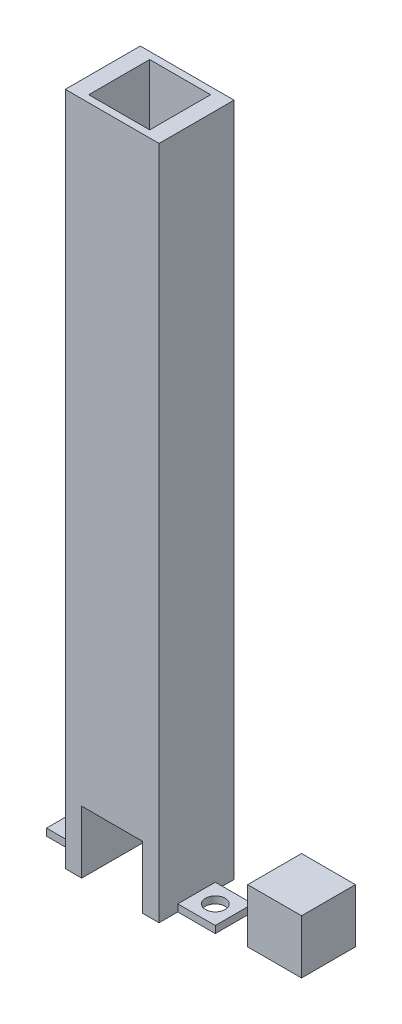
ISO-10303-21;
HEADER;
FILE_DESCRIPTION(('STEP AP214'),'2;1');
FILE_NAME('part.step','',(''),(''),'','','');
FILE_SCHEMA(('AUTOMOTIVE_DESIGN { 1 0 10303 214 1 1 1 1 }'));
ENDSEC;
DATA;
#1=APPLICATION_CONTEXT('core data for automotive mechanical design processes');
#2=APPLICATION_PROTOCOL_DEFINITION('international standard','automotive_design',2000,#1);
#3=PRODUCT_CONTEXT('',#1,'mechanical');
#4=PRODUCT('Part','Part','',(#3));
#5=PRODUCT_RELATED_PRODUCT_CATEGORY('part','',(#4));
#6=PRODUCT_DEFINITION_FORMATION('','',#4);
#7=PRODUCT_DEFINITION_CONTEXT('part definition',#1,'design');
#8=PRODUCT_DEFINITION('design','',#6,#7);
#9=PRODUCT_DEFINITION_SHAPE('','',#8);
#10=(LENGTH_UNIT() NAMED_UNIT(*) SI_UNIT(.MILLI.,.METRE.));
#11=(NAMED_UNIT(*) PLANE_ANGLE_UNIT() SI_UNIT($,.RADIAN.));
#12=(NAMED_UNIT(*) SI_UNIT($,.STERADIAN.) SOLID_ANGLE_UNIT());
#13=UNCERTAINTY_MEASURE_WITH_UNIT(LENGTH_MEASURE(1.E-05),#10,'distance_accuracy_value','');
#14=(GEOMETRIC_REPRESENTATION_CONTEXT(3) GLOBAL_UNCERTAINTY_ASSIGNED_CONTEXT((#13)) GLOBAL_UNIT_ASSIGNED_CONTEXT((#10,
#11,#12)) REPRESENTATION_CONTEXT('',''));
#15=CARTESIAN_POINT('',(0.,0.,0.));
#16=DIRECTION('',(0.,0.,1.));
#17=DIRECTION('',(1.,0.,0.));
#18=AXIS2_PLACEMENT_3D('',#15,#16,#17);
#19=CARTESIAN_POINT('',(-45.8981588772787,-12.,16.));
#20=DIRECTION('',(1.,0.,0.));
#21=DIRECTION('',(0.,0.,-1.));
#22=AXIS2_PLACEMENT_3D('',#19,#20,#21);
#23=PLANE('',#22);
#24=DIRECTION('',(0.,-1.,0.));
#25=VECTOR('',#24,1.);
#26=CARTESIAN_POINT('',(-45.8981588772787,-12.,4.));
#27=LINE('',#26,#25);
#28=CARTESIAN_POINT('',(-45.8981588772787,-10.5,4.));
#29=VERTEX_POINT('',#28);
#30=CARTESIAN_POINT('',(-45.8981588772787,-12.,4.));
#31=VERTEX_POINT('',#30);
#32=EDGE_CURVE('E69',#29,#31,#27,.T.);
#33=ORIENTED_EDGE('',*,*,#32,.F.);
#34=DIRECTION('',(0.,0.,-1.));
#35=VECTOR('',#34,1.);
#36=CARTESIAN_POINT('',(-45.8981588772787,-10.5,4.));
#37=LINE('',#36,#35);
#38=CARTESIAN_POINT('',(-45.8981588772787,-10.5,12.));
#39=VERTEX_POINT('',#38);
#40=EDGE_CURVE('E230',#39,#29,#37,.T.);
#41=ORIENTED_EDGE('',*,*,#40,.F.);
#42=DIRECTION('',(0.,1.,0.));
#43=VECTOR('',#42,1.);
#44=CARTESIAN_POINT('',(-45.8981588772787,-12.,12.));
#45=LINE('',#44,#43);
#46=CARTESIAN_POINT('',(-45.8981588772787,-12.,12.));
#47=VERTEX_POINT('',#46);
#48=EDGE_CURVE('E238',#47,#39,#45,.T.);
#49=ORIENTED_EDGE('',*,*,#48,.F.);
#50=DIRECTION('',(0.,0.,-1.));
#51=VECTOR('',#50,1.);
#52=CARTESIAN_POINT('',(-45.8981588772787,-12.,16.));
#53=LINE('',#52,#51);
#54=CARTESIAN_POINT('',(-45.8981588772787,-12.,16.));
#55=VERTEX_POINT('',#54);
#56=EDGE_CURVE('E12',#55,#47,#53,.T.);
#57=ORIENTED_EDGE('',*,*,#56,.F.);
#58=DIRECTION('',(0.,-1.,0.));
#59=VECTOR('',#58,1.);
#60=CARTESIAN_POINT('',(-45.8981588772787,-12.,16.));
#61=LINE('',#60,#59);
#62=CARTESIAN_POINT('',(-45.8981588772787,132.,16.));
#63=VERTEX_POINT('',#62);
#64=EDGE_CURVE('E310',#63,#55,#61,.T.);
#65=ORIENTED_EDGE('',*,*,#64,.F.);
#66=DIRECTION('',(0.,0.,-1.));
#67=VECTOR('',#66,1.);
#68=CARTESIAN_POINT('',(-45.8981588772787,132.,16.));
#69=LINE('',#68,#67);
#70=CARTESIAN_POINT('',(-45.8981588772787,132.,0.));
#71=VERTEX_POINT('',#70);
#72=EDGE_CURVE('E322',#63,#71,#69,.T.);
#73=ORIENTED_EDGE('',*,*,#72,.T.);
#74=DIRECTION('',(0.,-1.,0.));
#75=VECTOR('',#74,1.);
#76=CARTESIAN_POINT('',(-45.8981588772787,-12.,0.));
#77=LINE('',#76,#75);
#78=CARTESIAN_POINT('',(-45.8981588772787,-12.,0.));
#79=VERTEX_POINT('',#78);
#80=EDGE_CURVE('E304',#71,#79,#77,.T.);
#81=ORIENTED_EDGE('',*,*,#80,.T.);
#82=EDGE_CURVE('E54',#31,#79,#53,.T.);
#83=ORIENTED_EDGE('',*,*,#82,.F.);
#84=EDGE_LOOP('',(#33,#41,#49,#57,#65,#73,#81,#83));
#85=FACE_BOUND('',#84,.T.);
#86=ADVANCED_FACE('F47',(#85),#23,.F.);
#87=CARTESIAN_POINT('',(-45.8981588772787,-12.,16.));
#88=DIRECTION('',(0.,1.,0.));
#89=DIRECTION('',(0.,0.,1.));
#90=AXIS2_PLACEMENT_3D('',#87,#88,#89);
#91=PLANE('',#90);
#92=CARTESIAN_POINT('',(-49.8981588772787,-12.,8.));
#93=DIRECTION('',(0.,1.,0.));
#94=DIRECTION('',(0.,0.,1.));
#95=AXIS2_PLACEMENT_3D('',#92,#93,#94);
#96=CIRCLE('',#95,2.1);
#97=CARTESIAN_POINT('',(-49.8981588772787,-12.,10.1));
#98=VERTEX_POINT('',#97);
#99=EDGE_CURVE('E223',#98,#98,#96,.T.);
#100=ORIENTED_EDGE('',*,*,#99,.T.);
#101=EDGE_LOOP('',(#100));
#102=FACE_BOUND('',#101,.T.);
#103=DIRECTION('',(1.,0.,0.));
#104=VECTOR('',#103,1.);
#105=CARTESIAN_POINT('',(-45.8981588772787,-12.,0.));
#106=LINE('',#105,#104);
#107=CARTESIAN_POINT('',(-42.3981588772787,-12.,0.));
#108=VERTEX_POINT('',#107);
#109=EDGE_CURVE('E326',#79,#108,#106,.T.);
#110=ORIENTED_EDGE('',*,*,#109,.T.);
#111=DIRECTION('',(0.,0.,1.));
#112=VECTOR('',#111,1.);
#113=CARTESIAN_POINT('',(-42.3981588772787,-12.,1.5));
#114=LINE('',#113,#112);
#115=CARTESIAN_POINT('',(-42.3981588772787,-12.,16.));
#116=VERTEX_POINT('',#115);
#117=EDGE_CURVE('E288',#108,#116,#114,.T.);
#118=ORIENTED_EDGE('',*,*,#117,.T.);
#119=DIRECTION('',(1.,0.,0.));
#120=VECTOR('',#119,1.);
#121=CARTESIAN_POINT('',(-45.8981588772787,-12.,16.));
#122=LINE('',#121,#120);
#123=EDGE_CURVE('E315',#55,#116,#122,.T.);
#124=ORIENTED_EDGE('',*,*,#123,.F.);
#125=ORIENTED_EDGE('',*,*,#56,.T.);
#126=DIRECTION('',(1.,0.,0.));
#127=VECTOR('',#126,1.);
#128=CARTESIAN_POINT('',(-53.8981588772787,-12.,12.));
#129=LINE('',#128,#127);
#130=CARTESIAN_POINT('',(-53.8981588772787,-12.,12.));
#131=VERTEX_POINT('',#130);
#132=EDGE_CURVE('E247',#131,#47,#129,.T.);
#133=ORIENTED_EDGE('',*,*,#132,.F.);
#134=DIRECTION('',(0.,0.,1.));
#135=VECTOR('',#134,1.);
#136=CARTESIAN_POINT('',(-53.8981588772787,-12.,4.));
#137=LINE('',#136,#135);
#138=CARTESIAN_POINT('',(-53.8981588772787,-12.,4.));
#139=VERTEX_POINT('',#138);
#140=EDGE_CURVE('E229',#139,#131,#137,.T.);
#141=ORIENTED_EDGE('',*,*,#140,.F.);
#142=DIRECTION('',(1.,0.,0.));
#143=VECTOR('',#142,1.);
#144=CARTESIAN_POINT('',(-53.8981588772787,-12.,4.));
#145=LINE('',#144,#143);
#146=EDGE_CURVE('E250',#139,#31,#145,.T.);
#147=ORIENTED_EDGE('',*,*,#146,.T.);
#148=ORIENTED_EDGE('',*,*,#82,.T.);
#149=EDGE_LOOP('',(#110,#118,#124,#125,#133,#141,#147,#148));
#150=FACE_BOUND('',#149,.T.);
#151=ADVANCED_FACE('F382',(#102,#150),#91,.F.);
#152=CARTESIAN_POINT('',(-21.8981588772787,-12.,8.));
#153=DIRECTION('',(0.,1.,0.));
#154=DIRECTION('',(0.,0.,1.));
#155=AXIS2_PLACEMENT_3D('',#152,#153,#154);
#156=CIRCLE('',#155,2.1);
#157=CARTESIAN_POINT('',(-21.8981588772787,-12.,10.1));
#158=VERTEX_POINT('',#157);
#159=EDGE_CURVE('E213',#158,#158,#156,.F.);
#160=ORIENTED_EDGE('',*,*,#159,.F.);
#161=EDGE_LOOP('',(#160));
#162=FACE_BOUND('',#161,.T.);
#163=DIRECTION('',(0.,0.,1.));
#164=VECTOR('',#163,1.);
#165=CARTESIAN_POINT('',(-29.3981588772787,-12.,1.5));
#166=LINE('',#165,#164);
#167=CARTESIAN_POINT('',(-29.3981588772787,-12.,0.));
#168=VERTEX_POINT('',#167);
#169=CARTESIAN_POINT('',(-29.3981588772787,-12.,16.));
#170=VERTEX_POINT('',#169);
#171=EDGE_CURVE('E286',#168,#170,#166,.T.);
#172=ORIENTED_EDGE('',*,*,#171,.F.);
#173=CARTESIAN_POINT('',(-25.8981588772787,-12.,0.));
#174=VERTEX_POINT('',#173);
#175=EDGE_CURVE('E325',#168,#174,#106,.T.);
#176=ORIENTED_EDGE('',*,*,#175,.T.);
#177=DIRECTION('',(0.,0.,-1.));
#178=VECTOR('',#177,1.);
#179=CARTESIAN_POINT('',(-25.8981588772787,-12.,16.));
#180=LINE('',#179,#178);
#181=CARTESIAN_POINT('',(-25.8981588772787,-12.,4.));
#182=VERTEX_POINT('',#181);
#183=EDGE_CURVE('E336',#182,#174,#180,.T.);
#184=ORIENTED_EDGE('',*,*,#183,.F.);
#185=DIRECTION('',(-1.,0.,0.));
#186=VECTOR('',#185,1.);
#187=CARTESIAN_POINT('',(-17.8981588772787,-12.,4.));
#188=LINE('',#187,#186);
#189=CARTESIAN_POINT('',(-17.8981588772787,-12.,4.));
#190=VERTEX_POINT('',#189);
#191=EDGE_CURVE('E210',#190,#182,#188,.T.);
#192=ORIENTED_EDGE('',*,*,#191,.F.);
#193=DIRECTION('',(0.,0.,1.));
#194=VECTOR('',#193,1.);
#195=CARTESIAN_POINT('',(-17.8981588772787,-12.,4.));
#196=LINE('',#195,#194);
#197=CARTESIAN_POINT('',(-17.8981588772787,-12.,12.));
#198=VERTEX_POINT('',#197);
#199=EDGE_CURVE('E200',#190,#198,#196,.T.);
#200=ORIENTED_EDGE('',*,*,#199,.T.);
#201=DIRECTION('',(-1.,0.,0.));
#202=VECTOR('',#201,1.);
#203=CARTESIAN_POINT('',(-17.8981588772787,-12.,12.));
#204=LINE('',#203,#202);
#205=CARTESIAN_POINT('',(-25.8981588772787,-12.,12.));
#206=VERTEX_POINT('',#205);
#207=EDGE_CURVE('E218',#198,#206,#204,.T.);
#208=ORIENTED_EDGE('',*,*,#207,.T.);
#209=CARTESIAN_POINT('',(-25.8981588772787,-12.,16.));
#210=VERTEX_POINT('',#209);
#211=EDGE_CURVE('E337',#210,#206,#180,.T.);
#212=ORIENTED_EDGE('',*,*,#211,.F.);
#213=EDGE_CURVE('E313',#170,#210,#122,.T.);
#214=ORIENTED_EDGE('',*,*,#213,.F.);
#215=EDGE_LOOP('',(#172,#176,#184,#192,#200,#208,#212,#214));
#216=FACE_BOUND('',#215,.T.);
#217=ADVANCED_FACE('F349',(#162,#216),#91,.F.);
#218=CARTESIAN_POINT('',(-25.8981588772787,-12.,16.));
#219=DIRECTION('',(-1.,0.,0.));
#220=DIRECTION('',(0.,0.,1.));
#221=AXIS2_PLACEMENT_3D('',#218,#219,#220);
#222=PLANE('',#221);
#223=DIRECTION('',(0.,0.,-1.));
#224=VECTOR('',#223,1.);
#225=CARTESIAN_POINT('',(-25.8981588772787,-10.5,4.));
#226=LINE('',#225,#224);
#227=CARTESIAN_POINT('',(-25.8981588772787,-10.5,12.));
#228=VERTEX_POINT('',#227);
#229=CARTESIAN_POINT('',(-25.8981588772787,-10.5,4.));
#230=VERTEX_POINT('',#229);
#231=EDGE_CURVE('E212',#228,#230,#226,.T.);
#232=ORIENTED_EDGE('',*,*,#231,.T.);
#233=DIRECTION('',(0.,-1.,0.));
#234=VECTOR('',#233,1.);
#235=CARTESIAN_POINT('',(-25.8981588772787,-12.,4.));
#236=LINE('',#235,#234);
#237=EDGE_CURVE('E61',#230,#182,#236,.T.);
#238=ORIENTED_EDGE('',*,*,#237,.T.);
#239=ORIENTED_EDGE('',*,*,#183,.T.);
#240=DIRECTION('',(0.,1.,0.));
#241=VECTOR('',#240,1.);
#242=CARTESIAN_POINT('',(-25.8981588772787,-12.,0.));
#243=LINE('',#242,#241);
#244=CARTESIAN_POINT('',(-25.8981588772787,132.,0.));
#245=VERTEX_POINT('',#244);
#246=EDGE_CURVE('E329',#174,#245,#243,.T.);
#247=ORIENTED_EDGE('',*,*,#246,.T.);
#248=DIRECTION('',(0.,0.,-1.));
#249=VECTOR('',#248,1.);
#250=CARTESIAN_POINT('',(-25.8981588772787,132.,16.));
#251=LINE('',#250,#249);
#252=CARTESIAN_POINT('',(-25.8981588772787,132.,16.));
#253=VERTEX_POINT('',#252);
#254=EDGE_CURVE('E334',#253,#245,#251,.T.);
#255=ORIENTED_EDGE('',*,*,#254,.F.);
#256=DIRECTION('',(0.,1.,0.));
#257=VECTOR('',#256,1.);
#258=CARTESIAN_POINT('',(-25.8981588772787,-12.,16.));
#259=LINE('',#258,#257);
#260=EDGE_CURVE('E318',#210,#253,#259,.T.);
#261=ORIENTED_EDGE('',*,*,#260,.F.);
#262=ORIENTED_EDGE('',*,*,#211,.T.);
#263=DIRECTION('',(0.,1.,0.));
#264=VECTOR('',#263,1.);
#265=CARTESIAN_POINT('',(-25.8981588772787,-12.,12.));
#266=LINE('',#265,#264);
#267=EDGE_CURVE('E201',#206,#228,#266,.T.);
#268=ORIENTED_EDGE('',*,*,#267,.T.);
#269=EDGE_LOOP('',(#232,#238,#239,#247,#255,#261,#262,#268));
#270=FACE_BOUND('',#269,.T.);
#271=ADVANCED_FACE('F344',(#270),#222,.F.);
#272=CARTESIAN_POINT('',(-45.8981588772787,132.,16.));
#273=DIRECTION('',(0.,-1.,0.));
#274=DIRECTION('',(0.,0.,-1.));
#275=AXIS2_PLACEMENT_3D('',#272,#273,#274);
#276=PLANE('',#275);
#277=DIRECTION('',(0.,0.,1.));
#278=VECTOR('',#277,1.);
#279=CARTESIAN_POINT('',(-29.3981588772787,132.,1.5));
#280=LINE('',#279,#278);
#281=CARTESIAN_POINT('',(-29.3981588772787,132.,1.5));
#282=VERTEX_POINT('',#281);
#283=CARTESIAN_POINT('',(-29.3981588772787,132.,14.5));
#284=VERTEX_POINT('',#283);
#285=EDGE_CURVE('E294',#282,#284,#280,.T.);
#286=ORIENTED_EDGE('',*,*,#285,.T.);
#287=DIRECTION('',(1.,0.,0.));
#288=VECTOR('',#287,1.);
#289=CARTESIAN_POINT('',(-42.3981588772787,132.,14.5));
#290=LINE('',#289,#288);
#291=CARTESIAN_POINT('',(-42.3981588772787,132.,14.5));
#292=VERTEX_POINT('',#291);
#293=EDGE_CURVE('E285',#292,#284,#290,.T.);
#294=ORIENTED_EDGE('',*,*,#293,.F.);
#295=DIRECTION('',(0.,0.,1.));
#296=VECTOR('',#295,1.);
#297=CARTESIAN_POINT('',(-42.3981588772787,132.,1.5));
#298=LINE('',#297,#296);
#299=CARTESIAN_POINT('',(-42.3981588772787,132.,1.5));
#300=VERTEX_POINT('',#299);
#301=EDGE_CURVE('E289',#300,#292,#298,.T.);
#302=ORIENTED_EDGE('',*,*,#301,.F.);
#303=DIRECTION('',(1.,0.,0.));
#304=VECTOR('',#303,1.);
#305=CARTESIAN_POINT('',(-42.3981588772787,132.,1.5));
#306=LINE('',#305,#304);
#307=EDGE_CURVE('E297',#300,#282,#306,.T.);
#308=ORIENTED_EDGE('',*,*,#307,.T.);
#309=EDGE_LOOP('',(#286,#294,#302,#308));
#310=FACE_BOUND('',#309,.T.);
#311=DIRECTION('',(-1.,0.,0.));
#312=VECTOR('',#311,1.);
#313=CARTESIAN_POINT('',(-45.8981588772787,132.,0.));
#314=LINE('',#313,#312);
#315=EDGE_CURVE('E314',#245,#71,#314,.T.);
#316=ORIENTED_EDGE('',*,*,#315,.T.);
#317=ORIENTED_EDGE('',*,*,#72,.F.);
#318=DIRECTION('',(-1.,0.,0.));
#319=VECTOR('',#318,1.);
#320=CARTESIAN_POINT('',(-45.8981588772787,132.,16.));
#321=LINE('',#320,#319);
#322=EDGE_CURVE('E320',#253,#63,#321,.T.);
#323=ORIENTED_EDGE('',*,*,#322,.F.);
#324=ORIENTED_EDGE('',*,*,#254,.T.);
#325=EDGE_LOOP('',(#316,#317,#323,#324));
#326=FACE_BOUND('',#325,.T.);
#327=ADVANCED_FACE('F359',(#310,#326),#276,.F.);
#328=CARTESIAN_POINT('',(0.,0.,16.));
#329=DIRECTION('',(0.,0.,-1.));
#330=DIRECTION('',(-1.,0.,0.));
#331=AXIS2_PLACEMENT_3D('',#328,#329,#330);
#332=PLANE('',#331);
#333=ORIENTED_EDGE('',*,*,#123,.T.);
#334=DIRECTION('',(0.,-1.,0.));
#335=VECTOR('',#334,1.);
#336=CARTESIAN_POINT('',(-42.3981588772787,1.3,16.));
#337=LINE('',#336,#335);
#338=CARTESIAN_POINT('',(-42.3981588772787,1.3,16.));
#339=VERTEX_POINT('',#338);
#340=EDGE_CURVE('E269',#339,#116,#337,.T.);
#341=ORIENTED_EDGE('',*,*,#340,.F.);
#342=DIRECTION('',(-1.,0.,0.));
#343=VECTOR('',#342,1.);
#344=CARTESIAN_POINT('',(-29.3981588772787,1.3,16.));
#345=LINE('',#344,#343);
#346=CARTESIAN_POINT('',(-29.3981588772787,1.3,16.));
#347=VERTEX_POINT('',#346);
#348=EDGE_CURVE('E277',#347,#339,#345,.T.);
#349=ORIENTED_EDGE('',*,*,#348,.F.);
#350=DIRECTION('',(0.,-1.,0.));
#351=VECTOR('',#350,1.);
#352=CARTESIAN_POINT('',(-29.3981588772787,1.3,16.));
#353=LINE('',#352,#351);
#354=EDGE_CURVE('E274',#347,#170,#353,.T.);
#355=ORIENTED_EDGE('',*,*,#354,.T.);
#356=ORIENTED_EDGE('',*,*,#213,.T.);
#357=ORIENTED_EDGE('',*,*,#260,.T.);
#358=ORIENTED_EDGE('',*,*,#322,.T.);
#359=ORIENTED_EDGE('',*,*,#64,.T.);
#360=EDGE_LOOP('',(#333,#341,#349,#355,#356,#357,#358,#359));
#361=FACE_BOUND('',#360,.T.);
#362=ADVANCED_FACE('F364',(#361),#332,.F.);
#363=CARTESIAN_POINT('',(0.,0.,0.));
#364=DIRECTION('',(0.,0.,-1.));
#365=DIRECTION('',(-1.,0.,0.));
#366=AXIS2_PLACEMENT_3D('',#363,#364,#365);
#367=PLANE('',#366);
#368=DIRECTION('',(0.,-1.,0.));
#369=VECTOR('',#368,1.);
#370=CARTESIAN_POINT('',(-29.3981588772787,-4.,0.));
#371=LINE('',#370,#369);
#372=CARTESIAN_POINT('',(-29.3981588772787,-4.,0.));
#373=VERTEX_POINT('',#372);
#374=EDGE_CURVE('E253',#373,#168,#371,.T.);
#375=ORIENTED_EDGE('',*,*,#374,.F.);
#376=DIRECTION('',(1.,0.,0.));
#377=VECTOR('',#376,1.);
#378=CARTESIAN_POINT('',(-42.3981588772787,-4.,0.));
#379=LINE('',#378,#377);
#380=CARTESIAN_POINT('',(-42.3981588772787,-4.,0.));
#381=VERTEX_POINT('',#380);
#382=EDGE_CURVE('E261',#381,#373,#379,.T.);
#383=ORIENTED_EDGE('',*,*,#382,.F.);
#384=DIRECTION('',(0.,-1.,0.));
#385=VECTOR('',#384,1.);
#386=CARTESIAN_POINT('',(-42.3981588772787,-4.,0.));
#387=LINE('',#386,#385);
#388=EDGE_CURVE('E258',#381,#108,#387,.T.);
#389=ORIENTED_EDGE('',*,*,#388,.T.);
#390=ORIENTED_EDGE('',*,*,#109,.F.);
#391=ORIENTED_EDGE('',*,*,#80,.F.);
#392=ORIENTED_EDGE('',*,*,#315,.F.);
#393=ORIENTED_EDGE('',*,*,#246,.F.);
#394=ORIENTED_EDGE('',*,*,#175,.F.);
#395=EDGE_LOOP('',(#375,#383,#389,#390,#391,#392,#393,#394));
#396=FACE_BOUND('',#395,.T.);
#397=ADVANCED_FACE('F354',(#396),#367,.T.);
#398=CARTESIAN_POINT('',(-42.3981588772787,-12.,14.5));
#399=DIRECTION('',(0.,0.,1.));
#400=DIRECTION('',(1.,0.,0.));
#401=AXIS2_PLACEMENT_3D('',#398,#399,#400);
#402=PLANE('',#401);
#403=DIRECTION('',(0.,1.,0.));
#404=VECTOR('',#403,1.);
#405=CARTESIAN_POINT('',(-29.3981588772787,-12.,14.5));
#406=LINE('',#405,#404);
#407=CARTESIAN_POINT('',(-29.3981588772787,1.3,14.5));
#408=VERTEX_POINT('',#407);
#409=EDGE_CURVE('E291',#408,#284,#406,.T.);
#410=ORIENTED_EDGE('',*,*,#409,.F.);
#411=DIRECTION('',(-1.,0.,0.));
#412=VECTOR('',#411,1.);
#413=CARTESIAN_POINT('',(-29.3981588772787,1.3,14.5));
#414=LINE('',#413,#412);
#415=CARTESIAN_POINT('',(-42.3981588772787,1.3,14.5));
#416=VERTEX_POINT('',#415);
#417=EDGE_CURVE('E270',#408,#416,#414,.T.);
#418=ORIENTED_EDGE('',*,*,#417,.T.);
#419=DIRECTION('',(0.,1.,0.));
#420=VECTOR('',#419,1.);
#421=CARTESIAN_POINT('',(-42.3981588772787,-12.,14.5));
#422=LINE('',#421,#420);
#423=EDGE_CURVE('E302',#416,#292,#422,.T.);
#424=ORIENTED_EDGE('',*,*,#423,.T.);
#425=ORIENTED_EDGE('',*,*,#293,.T.);
#426=EDGE_LOOP('',(#410,#418,#424,#425));
#427=FACE_BOUND('',#426,.T.);
#428=ADVANCED_FACE('F400',(#427),#402,.F.);
#429=CARTESIAN_POINT('',(-42.3981588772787,-12.,1.5));
#430=DIRECTION('',(-1.,0.,0.));
#431=DIRECTION('',(0.,0.,1.));
#432=AXIS2_PLACEMENT_3D('',#429,#430,#431);
#433=PLANE('',#432);
#434=ORIENTED_EDGE('',*,*,#301,.T.);
#435=ORIENTED_EDGE('',*,*,#423,.F.);
#436=DIRECTION('',(0.,0.,1.));
#437=VECTOR('',#436,1.);
#438=CARTESIAN_POINT('',(-42.3981588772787,1.3,14.5));
#439=LINE('',#438,#437);
#440=EDGE_CURVE('E283',#416,#339,#439,.T.);
#441=ORIENTED_EDGE('',*,*,#440,.T.);
#442=ORIENTED_EDGE('',*,*,#340,.T.);
#443=ORIENTED_EDGE('',*,*,#117,.F.);
#444=ORIENTED_EDGE('',*,*,#388,.F.);
#445=DIRECTION('',(0.,0.,-1.));
#446=VECTOR('',#445,1.);
#447=CARTESIAN_POINT('',(-42.3981588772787,-4.,1.5));
#448=LINE('',#447,#446);
#449=CARTESIAN_POINT('',(-42.3981588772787,-4.,1.5));
#450=VERTEX_POINT('',#449);
#451=EDGE_CURVE('E257',#450,#381,#448,.T.);
#452=ORIENTED_EDGE('',*,*,#451,.F.);
#453=DIRECTION('',(0.,1.,0.));
#454=VECTOR('',#453,1.);
#455=CARTESIAN_POINT('',(-42.3981588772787,-12.,1.5));
#456=LINE('',#455,#454);
#457=EDGE_CURVE('E305',#450,#300,#456,.T.);
#458=ORIENTED_EDGE('',*,*,#457,.T.);
#459=EDGE_LOOP('',(#434,#435,#441,#442,#443,#444,#452,#458));
#460=FACE_BOUND('',#459,.T.);
#461=ADVANCED_FACE('F405',(#460),#433,.F.);
#462=CARTESIAN_POINT('',(-42.3981588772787,-12.,1.5));
#463=DIRECTION('',(0.,0.,1.));
#464=DIRECTION('',(1.,0.,0.));
#465=AXIS2_PLACEMENT_3D('',#462,#463,#464);
#466=PLANE('',#465);
#467=DIRECTION('',(1.,0.,0.));
#468=VECTOR('',#467,1.);
#469=CARTESIAN_POINT('',(-42.3981588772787,-4.,1.5));
#470=LINE('',#469,#468);
#471=CARTESIAN_POINT('',(-29.3981588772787,-4.,1.5));
#472=VERTEX_POINT('',#471);
#473=EDGE_CURVE('E254',#450,#472,#470,.T.);
#474=ORIENTED_EDGE('',*,*,#473,.T.);
#475=DIRECTION('',(0.,1.,0.));
#476=VECTOR('',#475,1.);
#477=CARTESIAN_POINT('',(-29.3981588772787,-12.,1.5));
#478=LINE('',#477,#476);
#479=EDGE_CURVE('E307',#472,#282,#478,.T.);
#480=ORIENTED_EDGE('',*,*,#479,.T.);
#481=ORIENTED_EDGE('',*,*,#307,.F.);
#482=ORIENTED_EDGE('',*,*,#457,.F.);
#483=EDGE_LOOP('',(#474,#480,#481,#482));
#484=FACE_BOUND('',#483,.T.);
#485=ADVANCED_FACE('F411',(#484),#466,.T.);
#486=CARTESIAN_POINT('',(-29.3981588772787,-12.,1.5));
#487=DIRECTION('',(-1.,0.,0.));
#488=DIRECTION('',(0.,0.,1.));
#489=AXIS2_PLACEMENT_3D('',#486,#487,#488);
#490=PLANE('',#489);
#491=ORIENTED_EDGE('',*,*,#285,.F.);
#492=ORIENTED_EDGE('',*,*,#479,.F.);
#493=DIRECTION('',(0.,0.,-1.));
#494=VECTOR('',#493,1.);
#495=CARTESIAN_POINT('',(-29.3981588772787,-4.,1.5));
#496=LINE('',#495,#494);
#497=EDGE_CURVE('E267',#472,#373,#496,.T.);
#498=ORIENTED_EDGE('',*,*,#497,.T.);
#499=ORIENTED_EDGE('',*,*,#374,.T.);
#500=ORIENTED_EDGE('',*,*,#171,.T.);
#501=ORIENTED_EDGE('',*,*,#354,.F.);
#502=DIRECTION('',(0.,0.,1.));
#503=VECTOR('',#502,1.);
#504=CARTESIAN_POINT('',(-29.3981588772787,1.3,14.5));
#505=LINE('',#504,#503);
#506=EDGE_CURVE('E273',#408,#347,#505,.T.);
#507=ORIENTED_EDGE('',*,*,#506,.F.);
#508=ORIENTED_EDGE('',*,*,#409,.T.);
#509=EDGE_LOOP('',(#491,#492,#498,#499,#500,#501,#507,#508));
#510=FACE_BOUND('',#509,.T.);
#511=ADVANCED_FACE('F407',(#510),#490,.T.);
#512=CARTESIAN_POINT('',(-29.3981588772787,1.3,14.5));
#513=DIRECTION('',(0.,1.,0.));
#514=DIRECTION('',(-1.,0.,0.));
#515=AXIS2_PLACEMENT_3D('',#512,#513,#514);
#516=PLANE('',#515);
#517=ORIENTED_EDGE('',*,*,#348,.T.);
#518=ORIENTED_EDGE('',*,*,#440,.F.);
#519=ORIENTED_EDGE('',*,*,#417,.F.);
#520=ORIENTED_EDGE('',*,*,#506,.T.);
#521=EDGE_LOOP('',(#517,#518,#519,#520));
#522=FACE_BOUND('',#521,.T.);
#523=ADVANCED_FACE('F410',(#522),#516,.F.);
#524=CARTESIAN_POINT('',(-42.3981588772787,-4.,1.5));
#525=DIRECTION('',(0.,1.,0.));
#526=DIRECTION('',(-1.,0.,0.));
#527=AXIS2_PLACEMENT_3D('',#524,#525,#526);
#528=PLANE('',#527);
#529=ORIENTED_EDGE('',*,*,#382,.T.);
#530=ORIENTED_EDGE('',*,*,#497,.F.);
#531=ORIENTED_EDGE('',*,*,#473,.F.);
#532=ORIENTED_EDGE('',*,*,#451,.T.);
#533=EDGE_LOOP('',(#529,#530,#531,#532));
#534=FACE_BOUND('',#533,.T.);
#535=ADVANCED_FACE('F421',(#534),#528,.F.);
#536=CARTESIAN_POINT('',(-53.8981588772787,-12.,4.));
#537=DIRECTION('',(0.,0.,1.));
#538=DIRECTION('',(1.,0.,0.));
#539=AXIS2_PLACEMENT_3D('',#536,#537,#538);
#540=PLANE('',#539);
#541=ORIENTED_EDGE('',*,*,#32,.T.);
#542=ORIENTED_EDGE('',*,*,#146,.F.);
#543=DIRECTION('',(0.,-1.,0.));
#544=VECTOR('',#543,1.);
#545=CARTESIAN_POINT('',(-53.8981588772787,-12.,4.));
#546=LINE('',#545,#544);
#547=CARTESIAN_POINT('',(-53.8981588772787,-10.5,4.));
#548=VERTEX_POINT('',#547);
#549=EDGE_CURVE('E226',#548,#139,#546,.T.);
#550=ORIENTED_EDGE('',*,*,#549,.F.);
#551=DIRECTION('',(1.,0.,0.));
#552=VECTOR('',#551,1.);
#553=CARTESIAN_POINT('',(-53.8981588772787,-10.5,4.));
#554=LINE('',#553,#552);
#555=EDGE_CURVE('E236',#548,#29,#554,.T.);
#556=ORIENTED_EDGE('',*,*,#555,.T.);
#557=EDGE_LOOP('',(#541,#542,#550,#556));
#558=FACE_BOUND('',#557,.T.);
#559=ADVANCED_FACE('F425',(#558),#540,.F.);
#560=CARTESIAN_POINT('',(-53.8981588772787,-12.,12.));
#561=DIRECTION('',(0.,0.,-1.));
#562=DIRECTION('',(-1.,0.,0.));
#563=AXIS2_PLACEMENT_3D('',#560,#561,#562);
#564=PLANE('',#563);
#565=ORIENTED_EDGE('',*,*,#48,.T.);
#566=DIRECTION('',(1.,0.,0.));
#567=VECTOR('',#566,1.);
#568=CARTESIAN_POINT('',(-53.8981588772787,-10.5,12.));
#569=LINE('',#568,#567);
#570=CARTESIAN_POINT('',(-53.8981588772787,-10.5,12.));
#571=VERTEX_POINT('',#570);
#572=EDGE_CURVE('E244',#571,#39,#569,.T.);
#573=ORIENTED_EDGE('',*,*,#572,.F.);
#574=DIRECTION('',(0.,1.,0.));
#575=VECTOR('',#574,1.);
#576=CARTESIAN_POINT('',(-53.8981588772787,-12.,12.));
#577=LINE('',#576,#575);
#578=EDGE_CURVE('E232',#131,#571,#577,.T.);
#579=ORIENTED_EDGE('',*,*,#578,.F.);
#580=ORIENTED_EDGE('',*,*,#132,.T.);
#581=EDGE_LOOP('',(#565,#573,#579,#580));
#582=FACE_BOUND('',#581,.T.);
#583=ADVANCED_FACE('F429',(#582),#564,.F.);
#584=CARTESIAN_POINT('',(-53.8981588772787,-10.5,4.));
#585=DIRECTION('',(0.,-1.,0.));
#586=DIRECTION('',(0.,0.,-1.));
#587=AXIS2_PLACEMENT_3D('',#584,#585,#586);
#588=PLANE('',#587);
#589=CARTESIAN_POINT('',(-49.8981588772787,-10.5,8.));
#590=DIRECTION('',(0.,1.,0.));
#591=DIRECTION('',(0.,0.,1.));
#592=AXIS2_PLACEMENT_3D('',#589,#590,#591);
#593=CIRCLE('',#592,2.1);
#594=CARTESIAN_POINT('',(-49.8981588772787,-10.5,10.1));
#595=VERTEX_POINT('',#594);
#596=EDGE_CURVE('E190',#595,#595,#593,.T.);
#597=ORIENTED_EDGE('',*,*,#596,.F.);
#598=EDGE_LOOP('',(#597));
#599=FACE_BOUND('',#598,.T.);
#600=ORIENTED_EDGE('',*,*,#40,.T.);
#601=ORIENTED_EDGE('',*,*,#555,.F.);
#602=DIRECTION('',(0.,0.,-1.));
#603=VECTOR('',#602,1.);
#604=CARTESIAN_POINT('',(-53.8981588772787,-10.5,4.));
#605=LINE('',#604,#603);
#606=EDGE_CURVE('E234',#571,#548,#605,.T.);
#607=ORIENTED_EDGE('',*,*,#606,.F.);
#608=ORIENTED_EDGE('',*,*,#572,.T.);
#609=EDGE_LOOP('',(#600,#601,#607,#608));
#610=FACE_BOUND('',#609,.T.);
#611=ADVANCED_FACE('F433',(#599,#610),#588,.F.);
#612=CARTESIAN_POINT('',(-53.8981588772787,0.,0.));
#613=DIRECTION('',(1.,0.,0.));
#614=DIRECTION('',(0.,0.,-1.));
#615=AXIS2_PLACEMENT_3D('',#612,#613,#614);
#616=PLANE('',#615);
#617=ORIENTED_EDGE('',*,*,#549,.T.);
#618=ORIENTED_EDGE('',*,*,#140,.T.);
#619=ORIENTED_EDGE('',*,*,#578,.T.);
#620=ORIENTED_EDGE('',*,*,#606,.T.);
#621=EDGE_LOOP('',(#617,#618,#619,#620));
#622=FACE_BOUND('',#621,.T.);
#623=ADVANCED_FACE('F437',(#622),#616,.F.);
#624=CARTESIAN_POINT('',(-49.8981588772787,-20.5,8.));
#625=DIRECTION('',(0.,1.,0.));
#626=DIRECTION('',(0.,0.,1.));
#627=AXIS2_PLACEMENT_3D('',#624,#625,#626);
#628=CYLINDRICAL_SURFACE('',#627,2.1);
#629=ORIENTED_EDGE('',*,*,#596,.T.);
#630=EDGE_LOOP('',(#629));
#631=FACE_BOUND('',#630,.T.);
#632=ORIENTED_EDGE('',*,*,#99,.F.);
#633=EDGE_LOOP('',(#632));
#634=FACE_BOUND('',#633,.T.);
#635=ADVANCED_FACE('F441',(#631,#634),#628,.F.);
#636=CARTESIAN_POINT('',(-17.8981588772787,-12.,4.));
#637=DIRECTION('',(0.,0.,-1.));
#638=DIRECTION('',(-1.,0.,0.));
#639=AXIS2_PLACEMENT_3D('',#636,#637,#638);
#640=PLANE('',#639);
#641=ORIENTED_EDGE('',*,*,#237,.F.);
#642=DIRECTION('',(-1.,0.,0.));
#643=VECTOR('',#642,1.);
#644=CARTESIAN_POINT('',(-17.8981588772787,-10.5,4.));
#645=LINE('',#644,#643);
#646=CARTESIAN_POINT('',(-17.8981588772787,-10.5,4.));
#647=VERTEX_POINT('',#646);
#648=EDGE_CURVE('E181',#647,#230,#645,.T.);
#649=ORIENTED_EDGE('',*,*,#648,.F.);
#650=DIRECTION('',(0.,-1.,0.));
#651=VECTOR('',#650,1.);
#652=CARTESIAN_POINT('',(-17.8981588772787,-12.,4.));
#653=LINE('',#652,#651);
#654=EDGE_CURVE('E184',#647,#190,#653,.T.);
#655=ORIENTED_EDGE('',*,*,#654,.T.);
#656=ORIENTED_EDGE('',*,*,#191,.T.);
#657=EDGE_LOOP('',(#641,#649,#655,#656));
#658=FACE_BOUND('',#657,.T.);
#659=ADVANCED_FACE('F183',(#658),#640,.T.);
#660=CARTESIAN_POINT('',(-17.8981588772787,-10.5,4.));
#661=DIRECTION('',(0.,1.,0.));
#662=DIRECTION('',(0.,0.,1.));
#663=AXIS2_PLACEMENT_3D('',#660,#661,#662);
#664=PLANE('',#663);
#665=CARTESIAN_POINT('',(-21.8981588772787,-10.5,8.));
#666=DIRECTION('',(0.,-1.,0.));
#667=DIRECTION('',(0.,0.,1.));
#668=AXIS2_PLACEMENT_3D('',#665,#666,#667);
#669=CIRCLE('',#668,2.1);
#670=CARTESIAN_POINT('',(-21.8981588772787,-10.5,10.1));
#671=VERTEX_POINT('',#670);
#672=EDGE_CURVE('E482',#671,#671,#669,.T.);
#673=ORIENTED_EDGE('',*,*,#672,.T.);
#674=EDGE_LOOP('',(#673));
#675=FACE_BOUND('',#674,.T.);
#676=ORIENTED_EDGE('',*,*,#231,.F.);
#677=DIRECTION('',(-1.,0.,0.));
#678=VECTOR('',#677,1.);
#679=CARTESIAN_POINT('',(-17.8981588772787,-10.5,12.));
#680=LINE('',#679,#678);
#681=CARTESIAN_POINT('',(-17.8981588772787,-10.5,12.));
#682=VERTEX_POINT('',#681);
#683=EDGE_CURVE('E191',#682,#228,#680,.T.);
#684=ORIENTED_EDGE('',*,*,#683,.F.);
#685=DIRECTION('',(0.,0.,-1.));
#686=VECTOR('',#685,1.);
#687=CARTESIAN_POINT('',(-17.8981588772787,-10.5,4.));
#688=LINE('',#687,#686);
#689=EDGE_CURVE('E197',#682,#647,#688,.T.);
#690=ORIENTED_EDGE('',*,*,#689,.T.);
#691=ORIENTED_EDGE('',*,*,#648,.T.);
#692=EDGE_LOOP('',(#676,#684,#690,#691));
#693=FACE_BOUND('',#692,.T.);
#694=ADVANCED_FACE('F203',(#675,#693),#664,.T.);
#695=CARTESIAN_POINT('',(-17.8981588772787,-12.,12.));
#696=DIRECTION('',(0.,0.,1.));
#697=DIRECTION('',(1.,0.,0.));
#698=AXIS2_PLACEMENT_3D('',#695,#696,#697);
#699=PLANE('',#698);
#700=ORIENTED_EDGE('',*,*,#267,.F.);
#701=ORIENTED_EDGE('',*,*,#207,.F.);
#702=DIRECTION('',(0.,1.,0.));
#703=VECTOR('',#702,1.);
#704=CARTESIAN_POINT('',(-17.8981588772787,-12.,12.));
#705=LINE('',#704,#703);
#706=EDGE_CURVE('E204',#198,#682,#705,.T.);
#707=ORIENTED_EDGE('',*,*,#706,.T.);
#708=ORIENTED_EDGE('',*,*,#683,.T.);
#709=EDGE_LOOP('',(#700,#701,#707,#708));
#710=FACE_BOUND('',#709,.T.);
#711=ADVANCED_FACE('F370',(#710),#699,.T.);
#712=CARTESIAN_POINT('',(-17.8981588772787,0.,0.));
#713=DIRECTION('',(-1.,0.,0.));
#714=DIRECTION('',(0.,0.,-1.));
#715=AXIS2_PLACEMENT_3D('',#712,#713,#714);
#716=PLANE('',#715);
#717=ORIENTED_EDGE('',*,*,#654,.F.);
#718=ORIENTED_EDGE('',*,*,#689,.F.);
#719=ORIENTED_EDGE('',*,*,#706,.F.);
#720=ORIENTED_EDGE('',*,*,#199,.F.);
#721=EDGE_LOOP('',(#717,#718,#719,#720));
#722=FACE_BOUND('',#721,.T.);
#723=ADVANCED_FACE('F195',(#722),#716,.F.);
#724=CARTESIAN_POINT('',(-21.8981588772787,-20.5,8.));
#725=DIRECTION('',(0.,1.,0.));
#726=DIRECTION('',(0.,0.,1.));
#727=AXIS2_PLACEMENT_3D('',#724,#725,#726);
#728=CYLINDRICAL_SURFACE('',#727,2.1);
#729=ORIENTED_EDGE('',*,*,#672,.F.);
#730=EDGE_LOOP('',(#729));
#731=FACE_BOUND('',#730,.T.);
#732=ORIENTED_EDGE('',*,*,#159,.T.);
#733=EDGE_LOOP('',(#732));
#734=FACE_BOUND('',#733,.T.);
#735=ADVANCED_FACE('F377',(#731,#734),#728,.F.);
#736=CLOSED_SHELL('',(#86,#151,#217,#271,#327,#362,#397,#428,#461,#485,#511,#523,#535,#559,#583,
#611,#623,#635,#659,#694,#711,#723,#735));
#737=MANIFOLD_SOLID_BREP('B2',#736);
#738=CARTESIAN_POINT('',(0.,0.,11.5));
#739=DIRECTION('',(-1.,0.,0.));
#740=DIRECTION('',(0.,-1.,0.));
#741=AXIS2_PLACEMENT_3D('',#738,#739,#740);
#742=PLANE('',#741);
#743=DIRECTION('',(0.,1.,0.));
#744=VECTOR('',#743,1.);
#745=CARTESIAN_POINT('',(0.,0.,0.));
#746=LINE('',#745,#744);
#747=CARTESIAN_POINT('',(0.,-11.5,0.));
#748=VERTEX_POINT('',#747);
#749=CARTESIAN_POINT('',(0.,0.,0.));
#750=VERTEX_POINT('',#749);
#751=EDGE_CURVE('E696',#748,#750,#746,.T.);
#752=ORIENTED_EDGE('',*,*,#751,.T.);
#753=DIRECTION('',(0.,0.,-1.));
#754=VECTOR('',#753,1.);
#755=CARTESIAN_POINT('',(0.,0.,11.5));
#756=LINE('',#755,#754);
#757=CARTESIAN_POINT('',(0.,0.,11.5));
#758=VERTEX_POINT('',#757);
#759=EDGE_CURVE('E45',#758,#750,#756,.T.);
#760=ORIENTED_EDGE('',*,*,#759,.F.);
#761=DIRECTION('',(0.,1.,0.));
#762=VECTOR('',#761,1.);
#763=CARTESIAN_POINT('',(0.,0.,11.5));
#764=LINE('',#763,#762);
#765=CARTESIAN_POINT('',(0.,-11.5,11.5));
#766=VERTEX_POINT('',#765);
#767=EDGE_CURVE('E684',#766,#758,#764,.T.);
#768=ORIENTED_EDGE('',*,*,#767,.F.);
#769=DIRECTION('',(0.,0.,-1.));
#770=VECTOR('',#769,1.);
#771=CARTESIAN_POINT('',(0.,-11.5,11.5));
#772=LINE('',#771,#770);
#773=EDGE_CURVE('E692',#766,#748,#772,.T.);
#774=ORIENTED_EDGE('',*,*,#773,.T.);
#775=EDGE_LOOP('',(#752,#760,#768,#774));
#776=FACE_BOUND('',#775,.T.);
#777=ADVANCED_FACE('F633',(#776),#742,.F.);
#778=CARTESIAN_POINT('',(0.,0.,11.5));
#779=DIRECTION('',(0.,-1.,0.));
#780=DIRECTION('',(1.,0.,0.));
#781=AXIS2_PLACEMENT_3D('',#778,#779,#780);
#782=PLANE('',#781);
#783=DIRECTION('',(-1.,0.,0.));
#784=VECTOR('',#783,1.);
#785=CARTESIAN_POINT('',(0.,0.,0.));
#786=LINE('',#785,#784);
#787=CARTESIAN_POINT('',(-11.5,0.,0.));
#788=VERTEX_POINT('',#787);
#789=EDGE_CURVE('E688',#750,#788,#786,.T.);
#790=ORIENTED_EDGE('',*,*,#789,.T.);
#791=DIRECTION('',(0.,0.,-1.));
#792=VECTOR('',#791,1.);
#793=CARTESIAN_POINT('',(-11.5,0.,11.5));
#794=LINE('',#793,#792);
#795=CARTESIAN_POINT('',(-11.5,0.,11.5));
#796=VERTEX_POINT('',#795);
#797=EDGE_CURVE('E641',#796,#788,#794,.T.);
#798=ORIENTED_EDGE('',*,*,#797,.F.);
#799=DIRECTION('',(-1.,0.,0.));
#800=VECTOR('',#799,1.);
#801=CARTESIAN_POINT('',(0.,0.,11.5));
#802=LINE('',#801,#800);
#803=EDGE_CURVE('E679',#758,#796,#802,.T.);
#804=ORIENTED_EDGE('',*,*,#803,.F.);
#805=ORIENTED_EDGE('',*,*,#759,.T.);
#806=EDGE_LOOP('',(#790,#798,#804,#805));
#807=FACE_BOUND('',#806,.T.);
#808=ADVANCED_FACE('F687',(#807),#782,.F.);
#809=CARTESIAN_POINT('',(-11.5,0.,11.5));
#810=DIRECTION('',(1.,0.,0.));
#811=DIRECTION('',(0.,1.,0.));
#812=AXIS2_PLACEMENT_3D('',#809,#810,#811);
#813=PLANE('',#812);
#814=DIRECTION('',(0.,-1.,0.));
#815=VECTOR('',#814,1.);
#816=CARTESIAN_POINT('',(-11.5,0.,0.));
#817=LINE('',#816,#815);
#818=CARTESIAN_POINT('',(-11.5,-11.5,0.));
#819=VERTEX_POINT('',#818);
#820=EDGE_CURVE('E666',#788,#819,#817,.T.);
#821=ORIENTED_EDGE('',*,*,#820,.T.);
#822=DIRECTION('',(0.,0.,-1.));
#823=VECTOR('',#822,1.);
#824=CARTESIAN_POINT('',(-11.5,-11.5,11.5));
#825=LINE('',#824,#823);
#826=CARTESIAN_POINT('',(-11.5,-11.5,11.5));
#827=VERTEX_POINT('',#826);
#828=EDGE_CURVE('E689',#827,#819,#825,.T.);
#829=ORIENTED_EDGE('',*,*,#828,.F.);
#830=DIRECTION('',(0.,-1.,0.));
#831=VECTOR('',#830,1.);
#832=CARTESIAN_POINT('',(-11.5,0.,11.5));
#833=LINE('',#832,#831);
#834=EDGE_CURVE('E682',#796,#827,#833,.T.);
#835=ORIENTED_EDGE('',*,*,#834,.F.);
#836=ORIENTED_EDGE('',*,*,#797,.T.);
#837=EDGE_LOOP('',(#821,#829,#835,#836));
#838=FACE_BOUND('',#837,.T.);
#839=ADVANCED_FACE('F690',(#838),#813,.F.);
#840=CARTESIAN_POINT('',(0.,-11.5,11.5));
#841=DIRECTION('',(0.,1.,0.));
#842=DIRECTION('',(-1.,0.,0.));
#843=AXIS2_PLACEMENT_3D('',#840,#841,#842);
#844=PLANE('',#843);
#845=DIRECTION('',(1.,0.,0.));
#846=VECTOR('',#845,1.);
#847=CARTESIAN_POINT('',(0.,-11.5,0.));
#848=LINE('',#847,#846);
#849=EDGE_CURVE('E672',#819,#748,#848,.T.);
#850=ORIENTED_EDGE('',*,*,#849,.T.);
#851=ORIENTED_EDGE('',*,*,#773,.F.);
#852=DIRECTION('',(1.,0.,0.));
#853=VECTOR('',#852,1.);
#854=CARTESIAN_POINT('',(0.,-11.5,11.5));
#855=LINE('',#854,#853);
#856=EDGE_CURVE('E649',#827,#766,#855,.T.);
#857=ORIENTED_EDGE('',*,*,#856,.F.);
#858=ORIENTED_EDGE('',*,*,#828,.T.);
#859=EDGE_LOOP('',(#850,#851,#857,#858));
#860=FACE_BOUND('',#859,.T.);
#861=ADVANCED_FACE('F703',(#860),#844,.F.);
#862=CARTESIAN_POINT('',(0.,0.,11.5));
#863=DIRECTION('',(0.,0.,-1.));
#864=DIRECTION('',(-1.,0.,0.));
#865=AXIS2_PLACEMENT_3D('',#862,#863,#864);
#866=PLANE('',#865);
#867=ORIENTED_EDGE('',*,*,#767,.T.);
#868=ORIENTED_EDGE('',*,*,#803,.T.);
#869=ORIENTED_EDGE('',*,*,#834,.T.);
#870=ORIENTED_EDGE('',*,*,#856,.T.);
#871=EDGE_LOOP('',(#867,#868,#869,#870));
#872=FACE_BOUND('',#871,.T.);
#873=ADVANCED_FACE('F680',(#872),#866,.F.);
#874=CARTESIAN_POINT('',(0.,0.,0.));
#875=DIRECTION('',(0.,0.,-1.));
#876=DIRECTION('',(-1.,0.,0.));
#877=AXIS2_PLACEMENT_3D('',#874,#875,#876);
#878=PLANE('',#877);
#879=ORIENTED_EDGE('',*,*,#751,.F.);
#880=ORIENTED_EDGE('',*,*,#849,.F.);
#881=ORIENTED_EDGE('',*,*,#820,.F.);
#882=ORIENTED_EDGE('',*,*,#789,.F.);
#883=EDGE_LOOP('',(#879,#880,#881,#882));
#884=FACE_BOUND('',#883,.T.);
#885=ADVANCED_FACE('F706',(#884),#878,.T.);
#886=CLOSED_SHELL('',(#777,#808,#839,#861,#873,#885));
#887=MANIFOLD_SOLID_BREP('B6_NOT_SHOWN',#886);
#888=ADVANCED_BREP_SHAPE_REPRESENTATION('',(#18,#737,#887),#14);
#889=SHAPE_DEFINITION_REPRESENTATION(#9,#888);
ENDSEC;
END-ISO-10303-21;
